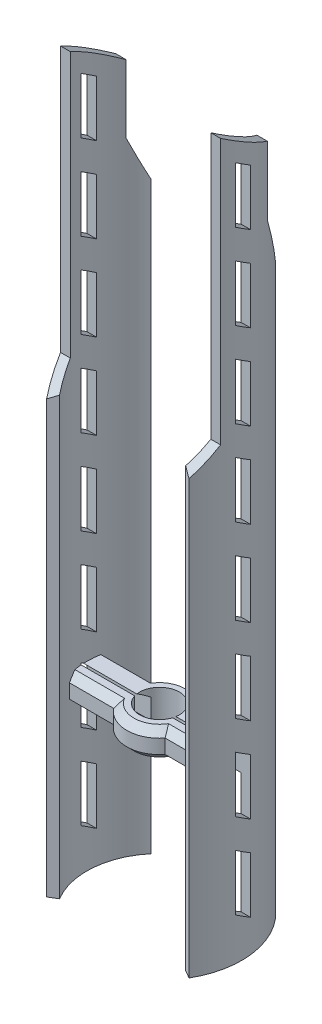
from build123d import *

# Parameters (mm, degrees)
SKETCH1_R                = 7
BOSS_EXTRUDE1_DEPTH      = 10
CHAMFER1_SIZE            = 2.5
BOSS_EXTRUDE2_DEPTH      = 54
BOSS_EXTRUDE2_DEPTH_BACK = 200
CUT_EXTRUDE1_DEPTH       = 147
CUT_EXTRUDE2_DEPTH       = 147
CUT_EXTRUDE3_DEPTH       = 263
LPATTERN1_COUNT          = 8
LPATTERN1_PITCH          = 30


with BuildPart() as part:
    # Sketch1 → Boss-Extrude1 (new body)
    with BuildSketch(Plane(origin=(0, 0, 0), x_dir=(1, 0, 0), z_dir=(0, 1, 0))):
        with BuildLine():
            Line((9.065900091, -7.075270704), (27.155712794, -7.075270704))
            Line((27.155712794, -7.075270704), (27.155712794, 7.075270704))
            Line((27.155712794, 7.075270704), (9.065900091, 7.075270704))
            ThreePointArc((9.065900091, 7.075270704), (0, 11.5), (-9.065900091, 7.075270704))
            Line((-9.065900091, 7.075270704), (-27.155712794, 7.075270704))
            Line((-27.155712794, 7.075270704), (-27.155712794, -7.075270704))
            Line((-27.155712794, -7.075270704), (-9.065900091, -7.075270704))
            ThreePointArc((-9.065900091, -7.075270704), (0, -11.5), (9.065900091, -7.075270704))
        make_face()
        with Locations(Location((0, 0, 0), (0, 0, 270))):
            Circle(SKETCH1_R, mode=Mode.SUBTRACT)
    extrude(amount=BOSS_EXTRUDE1_DEPTH)

    # Chamfer1
    chamfer1_edges = [part.edges().sort_by_distance(p)[0] for p in [
        (0, 10, -11.5),
        (18.110806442, 0, -7.075270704),
        (-18.110806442, 10, -7.075270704),
        (-18.110806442, 10, 7.075270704),
        (0, 10, 11.5),
        (18.110806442, 10, 7.075270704),
        (18.110806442, 10, -7.075270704),
        (18.110806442, 0, 7.075270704),
        (0, 0, 11.5),
        (-18.110806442, 0, 7.075270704),
        (-18.110806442, 0, -7.075270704),
        (0, 0, -11.5),
    ]]
    chamfer(chamfer1_edges, length=CHAMFER1_SIZE)

    # Sketch2 → Boss-Extrude2 (add, two sides: drawn at the far end of the back side and taken through both)
    with BuildSketch(Plane.XZ.offset(-BOSS_EXTRUDE2_DEPTH_BACK)):
        with BuildLine():
            Line((-19.620151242, -16.558149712), (-22.162422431, -18.703663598))
            ThreePointArc((-22.162422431, -18.703663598), (-28.910884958, -2.27172422), (-24.811736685, 15.012585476))
            Line((-24.811736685, 15.012585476), (-21.965560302, 13.290478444))
            ThreePointArc((-21.965560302, 13.290478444), (-25.594491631, -2.011132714), (-19.620151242, -16.558149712))
        make_face()
        with BuildLine():
            Line((22.162422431, 12.959540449), (25.034107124, 14.638766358))
            ThreePointArc((25.034107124, 14.638766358), (28.893035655, -2.488471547), (22.162422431, -18.703663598))
            Line((22.162422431, -18.703663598), (19.620151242, -16.558149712))
            ThreePointArc((19.620151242, -16.558149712), (25.578689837, -2.203016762), (22.162422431, 12.959540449))
        make_face()
    extrude(amount=BOSS_EXTRUDE2_DEPTH + BOSS_EXTRUDE2_DEPTH_BACK)

    # Sketch3 → Cut-Extrude1 (cut)
    with BuildSketch(Plane(origin=(34.679205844, 0, 0), x_dir=(0, 0, -1), z_dir=(1, 0, 0))):
        Polygon((-6.686863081, 200), (-6.686863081, 106.421624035), (-27.948760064, 85.159727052), (-27.948760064, 200), align=None)
        Polygon((11.291078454, 200), (11.291078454, 165.435113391), (28.332612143, 122.357903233), (28.332612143, 200), align=None)
    extrude(amount=-CUT_EXTRUDE1_DEPTH, mode=Mode.SUBTRACT)

    # Sketch4 → Cut-Extrude2 (cut)
    with BuildSketch(Plane(origin=(34.679205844, 0, 0), x_dir=(0, 0, -1), z_dir=(1, 0, 0))):
        Polygon((-6.686863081, 200), (11.291078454, 189.424261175), (11.291078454, 206.950684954), (-6.686863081, 206.950684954), align=None)
    extrude(amount=-CUT_EXTRUDE2_DEPTH, mode=Mode.SUBTRACT)

    # Sketch5 → Cut-Extrude3 (cut)
    with BuildSketch(Plane(origin=(34.679205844, 0, 0), x_dir=(0, 0, -1), z_dir=(1, 0, 0))):
        Polygon((-2.049958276, 170.897114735), (-2.049958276, 190.602849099), (3.255431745, 187.192241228), (3.255431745, 167.486506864), align=None)
    cut_extrude3 = extrude(amount=-CUT_EXTRUDE3_DEPTH, mode=Mode.SUBTRACT)

    # LPattern1: Cut-Extrude3 ×8
    with Locations(*[(0, -i * LPATTERN1_PITCH, 0) for i in range(1, LPATTERN1_COUNT)]):
        add(cut_extrude3, mode=Mode.SUBTRACT)


solid = part.part
